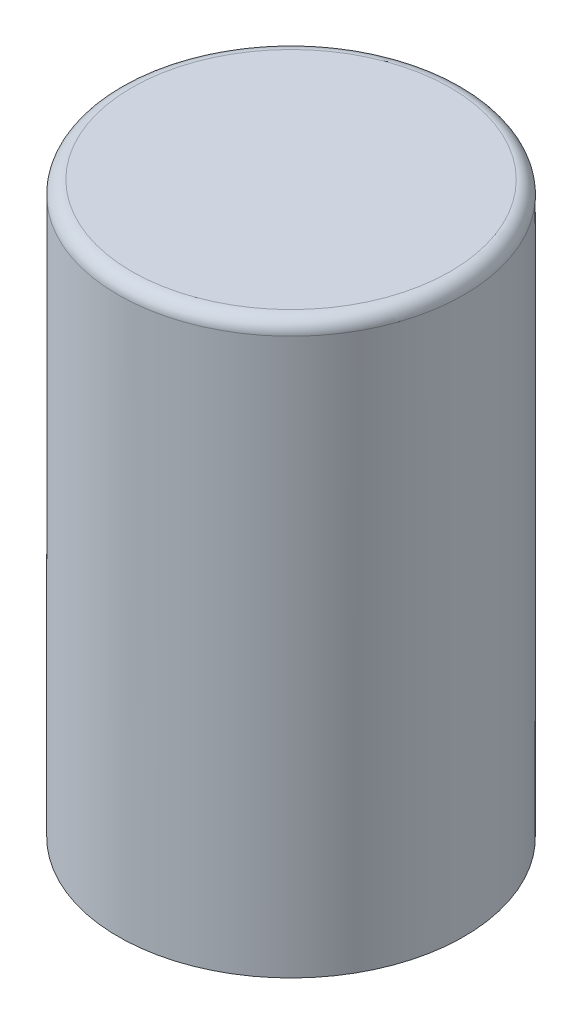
ISO-10303-21;
HEADER;
FILE_DESCRIPTION(('STEP AP214'),'2;1');
FILE_NAME('part.step','',(''),(''),'','','');
FILE_SCHEMA(('AUTOMOTIVE_DESIGN { 1 0 10303 214 1 1 1 1 }'));
ENDSEC;
DATA;
#1=APPLICATION_CONTEXT('core data for automotive mechanical design processes');
#2=APPLICATION_PROTOCOL_DEFINITION('international standard','automotive_design',2000,#1);
#3=PRODUCT_CONTEXT('',#1,'mechanical');
#4=PRODUCT('Part','Part','',(#3));
#5=PRODUCT_RELATED_PRODUCT_CATEGORY('part','',(#4));
#6=PRODUCT_DEFINITION_FORMATION('','',#4);
#7=PRODUCT_DEFINITION_CONTEXT('part definition',#1,'design');
#8=PRODUCT_DEFINITION('design','',#6,#7);
#9=PRODUCT_DEFINITION_SHAPE('','',#8);
#10=(LENGTH_UNIT() NAMED_UNIT(*) SI_UNIT(.MILLI.,.METRE.));
#11=(NAMED_UNIT(*) PLANE_ANGLE_UNIT() SI_UNIT($,.RADIAN.));
#12=(NAMED_UNIT(*) SI_UNIT($,.STERADIAN.) SOLID_ANGLE_UNIT());
#13=UNCERTAINTY_MEASURE_WITH_UNIT(LENGTH_MEASURE(1.E-05),#10,'distance_accuracy_value','');
#14=(GEOMETRIC_REPRESENTATION_CONTEXT(3) GLOBAL_UNCERTAINTY_ASSIGNED_CONTEXT((#13)) GLOBAL_UNIT_ASSIGNED_CONTEXT((#10,
#11,#12)) REPRESENTATION_CONTEXT('',''));
#15=CARTESIAN_POINT('',(0.,0.,0.));
#16=DIRECTION('',(0.,0.,1.));
#17=DIRECTION('',(1.,0.,0.));
#18=AXIS2_PLACEMENT_3D('',#15,#16,#17);
#19=CARTESIAN_POINT('',(-64.6423563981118,20.7590099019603,-22.6188603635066));
#20=DIRECTION('',(0.,-1.,0.));
#21=DIRECTION('',(0.,0.,-1.));
#22=AXIS2_PLACEMENT_3D('',#19,#20,#21);
#23=CYLINDRICAL_SURFACE('',#22,2.23125);
#24=CARTESIAN_POINT('',(-64.6423563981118,20.5840099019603,-22.6188603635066));
#25=DIRECTION('',(0.,1.,0.));
#26=DIRECTION('',(0.,0.,1.));
#27=AXIS2_PLACEMENT_3D('',#24,#25,#26);
#28=CIRCLE('',#27,2.23125);
#29=CARTESIAN_POINT('',(-64.6423563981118,20.5840099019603,-24.8501103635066));
#30=VERTEX_POINT('',#29);
#31=EDGE_CURVE('E10',#30,#30,#28,.F.);
#32=CARTESIAN_POINT('',(-64.6423563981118,13.4090099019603,-22.6188603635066));
#33=DIRECTION('',(0.,1.,0.));
#34=DIRECTION('',(0.,0.,1.));
#35=AXIS2_PLACEMENT_3D('',#32,#33,#34);
#36=CIRCLE('',#35,2.23125);
#37=CARTESIAN_POINT('',(-64.6423563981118,13.4090099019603,-24.8501103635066));
#38=VERTEX_POINT('',#37);
#39=EDGE_CURVE('E46',#38,#38,#36,.T.);
#40=CARTESIAN_POINT('',(-64.6423563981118,20.5840099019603,-24.8501103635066));
#41=CARTESIAN_POINT('',(-64.6423563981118,20.509270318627,-24.8501103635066));
#42=CARTESIAN_POINT('',(-64.6423563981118,20.4345307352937,-24.8501103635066));
#43=CARTESIAN_POINT('',(-64.6423563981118,20.285051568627,-24.8501103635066));
#44=CARTESIAN_POINT('',(-64.6423563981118,20.2103119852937,-24.8501103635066));
#45=CARTESIAN_POINT('',(-64.6423563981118,20.060832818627,-24.8501103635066));
#46=CARTESIAN_POINT('',(-64.6423563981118,19.9860932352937,-24.8501103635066));
#47=CARTESIAN_POINT('',(-64.6423563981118,19.836614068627,-24.8501103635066));
#48=CARTESIAN_POINT('',(-64.6423563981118,19.7618744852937,-24.8501103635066));
#49=CARTESIAN_POINT('',(-64.6423563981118,19.612395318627,-24.8501103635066));
#50=CARTESIAN_POINT('',(-64.6423563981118,19.5376557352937,-24.8501103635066));
#51=CARTESIAN_POINT('',(-64.6423563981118,19.388176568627,-24.8501103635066));
#52=CARTESIAN_POINT('',(-64.6423563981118,19.3134369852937,-24.8501103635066));
#53=CARTESIAN_POINT('',(-64.6423563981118,19.163957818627,-24.8501103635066));
#54=CARTESIAN_POINT('',(-64.6423563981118,19.0892182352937,-24.8501103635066));
#55=CARTESIAN_POINT('',(-64.6423563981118,18.939739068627,-24.8501103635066));
#56=CARTESIAN_POINT('',(-64.6423563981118,18.8649994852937,-24.8501103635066));
#57=CARTESIAN_POINT('',(-64.6423563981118,18.715520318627,-24.8501103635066));
#58=CARTESIAN_POINT('',(-64.6423563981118,18.6407807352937,-24.8501103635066));
#59=CARTESIAN_POINT('',(-64.6423563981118,18.491301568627,-24.8501103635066));
#60=CARTESIAN_POINT('',(-64.6423563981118,18.4165619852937,-24.8501103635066));
#61=CARTESIAN_POINT('',(-64.6423563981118,18.267082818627,-24.8501103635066));
#62=CARTESIAN_POINT('',(-64.6423563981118,18.1923432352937,-24.8501103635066));
#63=CARTESIAN_POINT('',(-64.6423563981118,18.042864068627,-24.8501103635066));
#64=CARTESIAN_POINT('',(-64.6423563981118,17.9681244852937,-24.8501103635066));
#65=CARTESIAN_POINT('',(-64.6423563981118,17.818645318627,-24.8501103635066));
#66=CARTESIAN_POINT('',(-64.6423563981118,17.7439057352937,-24.8501103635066));
#67=CARTESIAN_POINT('',(-64.6423563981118,17.594426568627,-24.8501103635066));
#68=CARTESIAN_POINT('',(-64.6423563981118,17.5196869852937,-24.8501103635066));
#69=CARTESIAN_POINT('',(-64.6423563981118,17.370207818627,-24.8501103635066));
#70=CARTESIAN_POINT('',(-64.6423563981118,17.2954682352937,-24.8501103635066));
#71=CARTESIAN_POINT('',(-64.6423563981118,17.145989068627,-24.8501103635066));
#72=CARTESIAN_POINT('',(-64.6423563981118,17.0712494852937,-24.8501103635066));
#73=CARTESIAN_POINT('',(-64.6423563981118,16.921770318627,-24.8501103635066));
#74=CARTESIAN_POINT('',(-64.6423563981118,16.8470307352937,-24.8501103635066));
#75=CARTESIAN_POINT('',(-64.6423563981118,16.697551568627,-24.8501103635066));
#76=CARTESIAN_POINT('',(-64.6423563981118,16.6228119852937,-24.8501103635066));
#77=CARTESIAN_POINT('',(-64.6423563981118,16.473332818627,-24.8501103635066));
#78=CARTESIAN_POINT('',(-64.6423563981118,16.3985932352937,-24.8501103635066));
#79=CARTESIAN_POINT('',(-64.6423563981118,16.249114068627,-24.8501103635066));
#80=CARTESIAN_POINT('',(-64.6423563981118,16.1743744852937,-24.8501103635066));
#81=CARTESIAN_POINT('',(-64.6423563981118,16.024895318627,-24.8501103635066));
#82=CARTESIAN_POINT('',(-64.6423563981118,15.9501557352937,-24.8501103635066));
#83=CARTESIAN_POINT('',(-64.6423563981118,15.800676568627,-24.8501103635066));
#84=CARTESIAN_POINT('',(-64.6423563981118,15.7259369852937,-24.8501103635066));
#85=CARTESIAN_POINT('',(-64.6423563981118,15.576457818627,-24.8501103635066));
#86=CARTESIAN_POINT('',(-64.6423563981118,15.5017182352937,-24.8501103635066));
#87=CARTESIAN_POINT('',(-64.6423563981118,15.352239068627,-24.8501103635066));
#88=CARTESIAN_POINT('',(-64.6423563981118,15.2774994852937,-24.8501103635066));
#89=CARTESIAN_POINT('',(-64.6423563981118,15.128020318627,-24.8501103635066));
#90=CARTESIAN_POINT('',(-64.6423563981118,15.0532807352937,-24.8501103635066));
#91=CARTESIAN_POINT('',(-64.6423563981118,14.903801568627,-24.8501103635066));
#92=CARTESIAN_POINT('',(-64.6423563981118,14.8290619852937,-24.8501103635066));
#93=CARTESIAN_POINT('',(-64.6423563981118,14.679582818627,-24.8501103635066));
#94=CARTESIAN_POINT('',(-64.6423563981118,14.6048432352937,-24.8501103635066));
#95=CARTESIAN_POINT('',(-64.6423563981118,14.455364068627,-24.8501103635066));
#96=CARTESIAN_POINT('',(-64.6423563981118,14.3806244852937,-24.8501103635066));
#97=CARTESIAN_POINT('',(-64.6423563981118,14.231145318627,-24.8501103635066));
#98=CARTESIAN_POINT('',(-64.6423563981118,14.1564057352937,-24.8501103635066));
#99=CARTESIAN_POINT('',(-64.6423563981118,14.006926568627,-24.8501103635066));
#100=CARTESIAN_POINT('',(-64.6423563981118,13.9321869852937,-24.8501103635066));
#101=CARTESIAN_POINT('',(-64.6423563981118,13.782707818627,-24.8501103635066));
#102=CARTESIAN_POINT('',(-64.6423563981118,13.7079682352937,-24.8501103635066));
#103=CARTESIAN_POINT('',(-64.6423563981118,13.558489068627,-24.8501103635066));
#104=CARTESIAN_POINT('',(-64.6423563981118,13.4837494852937,-24.8501103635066));
#105=CARTESIAN_POINT('',(-64.6423563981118,13.4090099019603,-24.8501103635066));
#106=B_SPLINE_CURVE_WITH_KNOTS('',3,(#40,#41,#42,#43,#44,#45,#46,#47,#48,#49,#50,#51,#52,#53,
#54,#55,#56,#57,#58,#59,#60,#61,#62,#63,#64,#65,#66,#67,#68,#69,#70,#71,#72,#73,#74,#75,#76,#77,
#78,#79,#80,#81,#82,#83,#84,#85,#86,#87,#88,#89,#90,#91,#92,#93,#94,#95,#96,#97,#98,#99,#100,
#101,#102,#103,#104,#105),.UNSPECIFIED.,.F.,.F.,(4,2,2,2,2,2,2,2,2,2,2,2,2,2,2,2,2,2,2,2,2,2,2,
2,2,2,2,2,2,2,2,2,4),(0.,0.224218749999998,0.448437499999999,0.672656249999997,
0.896874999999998,1.12109375,1.3453125,1.56953125,1.79375,2.01796875,2.2421875,2.46640625,
2.690625,2.91484375,3.1390625,3.36328125,3.5875,3.81171875,4.0359375,4.26015625,4.484375,
4.70859375,4.9328125,5.15703125,5.38125,5.60546875,5.8296875,6.05390625,6.278125,6.50234375,
6.7265625,6.95078125,7.175),.UNSPECIFIED.);
#107=EDGE_CURVE('BSEAM36',#30,#38,#106,.T.);
#108=ORIENTED_EDGE('',*,*,#31,.T.);
#109=ORIENTED_EDGE('',*,*,#39,.T.);
#110=ORIENTED_EDGE('',*,*,#107,.T.);
#111=ORIENTED_EDGE('',*,*,#107,.F.);
#112=EDGE_LOOP('',(#108,#110,#109,#111));
#113=FACE_BOUND('',#112,.T.);
#114=ADVANCED_FACE('F36',(#113),#23,.T.);
#115=CARTESIAN_POINT('',(-64.6423563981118,20.7590099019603,-22.6188603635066));
#116=DIRECTION('',(0.,1.,0.));
#117=DIRECTION('',(0.,0.,1.));
#118=AXIS2_PLACEMENT_3D('',#115,#116,#117);
#119=PLANE('',#118);
#120=CARTESIAN_POINT('',(-64.6423563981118,20.7590099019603,-22.6188603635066));
#121=DIRECTION('',(0.,1.,0.));
#122=DIRECTION('',(0.,0.,1.));
#123=AXIS2_PLACEMENT_3D('',#120,#121,#122);
#124=CIRCLE('',#123,2.05625);
#125=CARTESIAN_POINT('',(-64.6423563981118,20.7590099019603,-20.5626103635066));
#126=VERTEX_POINT('',#125);
#127=EDGE_CURVE('E42',#126,#126,#124,.T.);
#128=ORIENTED_EDGE('',*,*,#127,.T.);
#129=EDGE_LOOP('',(#128));
#130=FACE_BOUND('',#129,.T.);
#131=ADVANCED_FACE('F57',(#130),#119,.T.);
#132=CARTESIAN_POINT('',(-64.6423563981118,13.4090099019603,-22.6188603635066));
#133=DIRECTION('',(0.,1.,0.));
#134=DIRECTION('',(0.,0.,1.));
#135=AXIS2_PLACEMENT_3D('',#132,#133,#134);
#136=PLANE('',#135);
#137=ORIENTED_EDGE('',*,*,#39,.F.);
#138=EDGE_LOOP('',(#137));
#139=FACE_BOUND('',#138,.T.);
#140=ADVANCED_FACE('F54',(#139),#136,.F.);
#141=CARTESIAN_POINT('',(-64.6423563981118,20.5840099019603,-22.6188603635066));
#142=DIRECTION('',(0.,1.,0.));
#143=DIRECTION('',(0.,0.,1.));
#144=AXIS2_PLACEMENT_3D('',#141,#142,#143);
#145=TOROIDAL_SURFACE('',#144,2.05625,0.175);
#146=ORIENTED_EDGE('',*,*,#31,.F.);
#147=EDGE_LOOP('',(#146));
#148=FACE_BOUND('',#147,.T.);
#149=ORIENTED_EDGE('',*,*,#127,.F.);
#150=EDGE_LOOP('',(#149));
#151=FACE_BOUND('',#150,.T.);
#152=ADVANCED_FACE('F56',(#148,#151),#145,.T.);
#153=CLOSED_SHELL('',(#114,#131,#140,#152));
#154=MANIFOLD_SOLID_BREP('B2',#153);
#155=ADVANCED_BREP_SHAPE_REPRESENTATION('',(#18,#154),#14);
#156=SHAPE_DEFINITION_REPRESENTATION(#9,#155);
ENDSEC;
END-ISO-10303-21;
